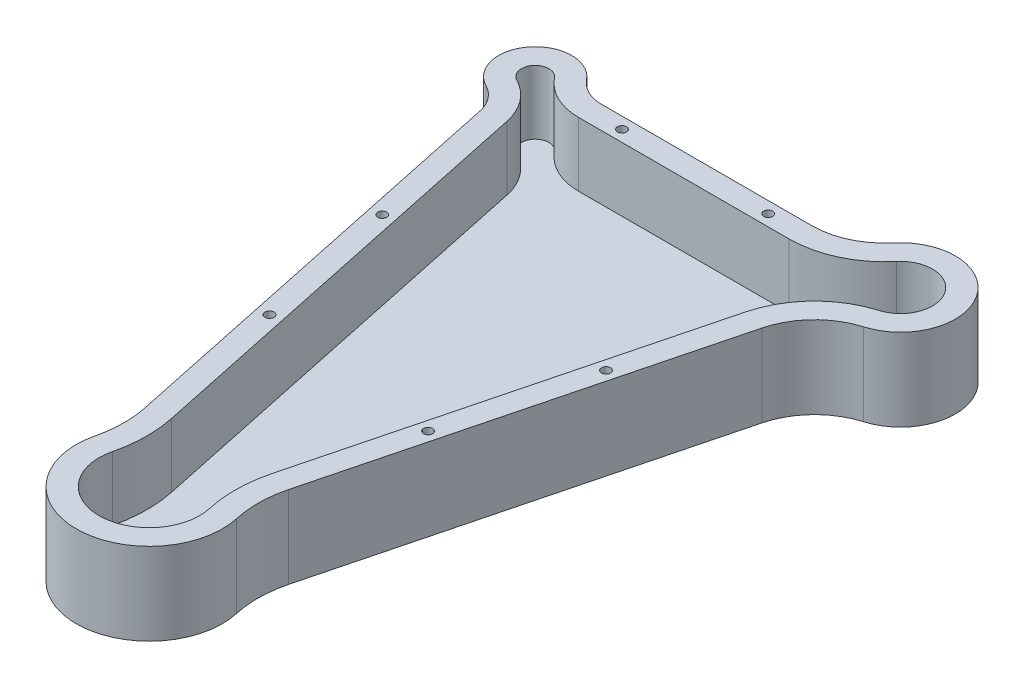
from build123d import *

# Parameters (mm, degrees)
EXTRUDE1_DEPTH                    = 12.7
EXTRUDE_THIN1_DEPTH               = 44.45
F_1_4_28_TAPPED_HOLE1_D           = 5.4102
F_1_4_28_TAPPED_HOLE1_DEPTH       = 15.4202892
F_1_4_28_TAPPED_HOLE1_CBORE_D     = 6.35
F_1_4_28_TAPPED_HOLE1_CBORE_DEPTH = 12.7
F_1_4_28_TAPPED_HOLE1_TIP         = 1.625388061


with BuildPart() as part:
    # Sketch1 → Extrude1 (new body)
    with BuildSketch(Plane(origin=(0, 0, 0), x_dir=(1, 0, 0), z_dir=(0, 1, 0))):
        with BuildLine():
            Line((-111.232563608, 103.0165067), (-48.879605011, -192.57011532))
            ThreePointArc((-48.879605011, -192.57011532), (-47.247052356, -209.421078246), (-49.375510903, -226.216608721))
            ThreePointArc((-49.375510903, -226.216608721), (-0.437371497, -288.960391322), (49.573879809, -227.068562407))
            ThreePointArc((49.573879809, -227.068562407), (47.744123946, -209.22958187), (50.134019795, -191.456972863))
            Line((50.134019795, -191.456972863), (117.438914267, 70.371145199))
            ThreePointArc((117.438914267, 70.371145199), (130.035910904, 92.949171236), (152.114136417, 106.402926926))
            ThreePointArc((152.114136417, 106.402926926), (173.062788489, 163.8326087), (112.036143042, 167.405131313))
            ThreePointArc((112.036143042, 167.405131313), (94.590967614, 154.020864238), (73.124049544, 149.262274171))
            Line((73.124049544, 149.262274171), (-73.124049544, 149.262274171))
            ThreePointArc((-73.124049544, 149.262274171), (-84.122572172, 151.767023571), (-92.951918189, 158.787274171))
            ThreePointArc((-92.951918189, 158.787274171), (-132.431679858, 159.00460466), (-124.432703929, 120.343057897))
            ThreePointArc((-124.432703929, 120.343057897), (-115.881069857, 113.166570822), (-111.232563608, 103.0165067))
        make_face()
    extrude(amount=EXTRUDE1_DEPTH)

    # Sketch2 → Extrude-Thin1 (add)
    with BuildSketch(Plane(origin=(0, 12.7, 0), x_dir=(-1, 0, 0), z_dir=(0, 1, 0))):
        with BuildLine():
            Line((-73.124049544, -149.262274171), (73.124049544, -149.262274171))
            ThreePointArc((73.124049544, -149.262274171), (84.122572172, -151.767023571), (92.951918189, -158.787274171))
            ThreePointArc((92.951918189, -158.787274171), (132.431679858, -159.00460466), (124.432703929, -120.343057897))
            ThreePointArc((124.432703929, -120.343057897), (115.881069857, -113.166570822), (111.232563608, -103.0165067))
            Line((111.232563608, -103.0165067), (48.879605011, 192.57011532))
            ThreePointArc((48.879605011, 192.57011532), (47.247052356, 209.421078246), (49.375510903, 226.216608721))
            ThreePointArc((49.375510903, 226.216608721), (0.437371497, 288.960391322), (-49.573879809, 227.068562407))
            ThreePointArc((-49.573879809, 227.068562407), (-47.744123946, 209.22958187), (-50.134019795, 191.456972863))
            Line((-50.134019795, 191.456972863), (-117.438914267, -70.371145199))
            ThreePointArc((-117.438914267, -70.371145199), (-130.035910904, -92.949171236), (-152.114136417, -106.402926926))
            ThreePointArc((-152.114136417, -106.402926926), (-173.062788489, -163.8326087), (-112.036143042, -167.405131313))
            ThreePointArc((-112.036143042, -167.405131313), (-94.590967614, -154.020864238), (-73.124049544, -149.262274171))
        make_face()
        with BuildLine():
            Line((-73.124049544, -133.387274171), (73.124049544, -133.387274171))
            ThreePointArc((73.124049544, -133.387274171), (90.996648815, -137.457491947), (105.344336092, -148.865399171))
            ThreePointArc((105.344336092, -148.865399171), (120.149246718, -148.946898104), (117.149630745, -134.448818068))
            ThreePointArc((117.149630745, -134.448818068), (103.253225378, -122.787026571), (95.699402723, -106.293172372))
            Line((95.699402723, -106.293172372), (33.346444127, 189.293449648))
            ThreePointArc((33.346444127, 189.293449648), (31.373776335, 209.65502985), (33.945663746, 229.949629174))
            ThreePointArc((33.945663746, 229.949629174), (0.300692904, 273.085979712), (-34.082042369, 230.535347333))
            ThreePointArc((-34.082042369, 230.535347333), (-31.871087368, 208.979912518), (-34.758878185, 187.504676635))
            Line((-34.758878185, 187.504676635), (-102.063772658, -74.323441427))
            ThreePointArc((-102.063772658, -74.323441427), (-118.597330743, -103.957100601), (-147.575001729, -121.615154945))
            ThreePointArc((-147.575001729, -121.615154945), (-159.795048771, -155.115802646), (-124.196172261, -157.199774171))
            ThreePointArc((-124.196172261, -157.199774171), (-101.299379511, -139.632923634), (-73.124049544, -133.387274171))
        make_face(mode=Mode.SUBTRACT)
    extrude(amount=EXTRUDE_THIN1_DEPTH)

    # 1_4-28 Tapped Hole1
    with Locations(Plane(origin=(0, 57.15, 0), x_dir=(-1, 0, 0), z_dir=(0, 1, 0))):
        with Locations((50.8, -141.324774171), (-50.8, -141.324774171), (-88.746244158, 9.366312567), (-63.451548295, 107.767218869), (61.804173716, 92.844586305), (82.774834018, -6.567643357)):
            CounterBoreHole(F_1_4_28_TAPPED_HOLE1_D / 2, F_1_4_28_TAPPED_HOLE1_CBORE_D / 2, F_1_4_28_TAPPED_HOLE1_CBORE_DEPTH, depth=F_1_4_28_TAPPED_HOLE1_DEPTH)
            with Locations((0, 0, -(F_1_4_28_TAPPED_HOLE1_DEPTH + F_1_4_28_TAPPED_HOLE1_TIP / 2))):  # 118° drill point
                Cone(0, F_1_4_28_TAPPED_HOLE1_D / 2, F_1_4_28_TAPPED_HOLE1_TIP, mode=Mode.SUBTRACT)


solid = part.part
